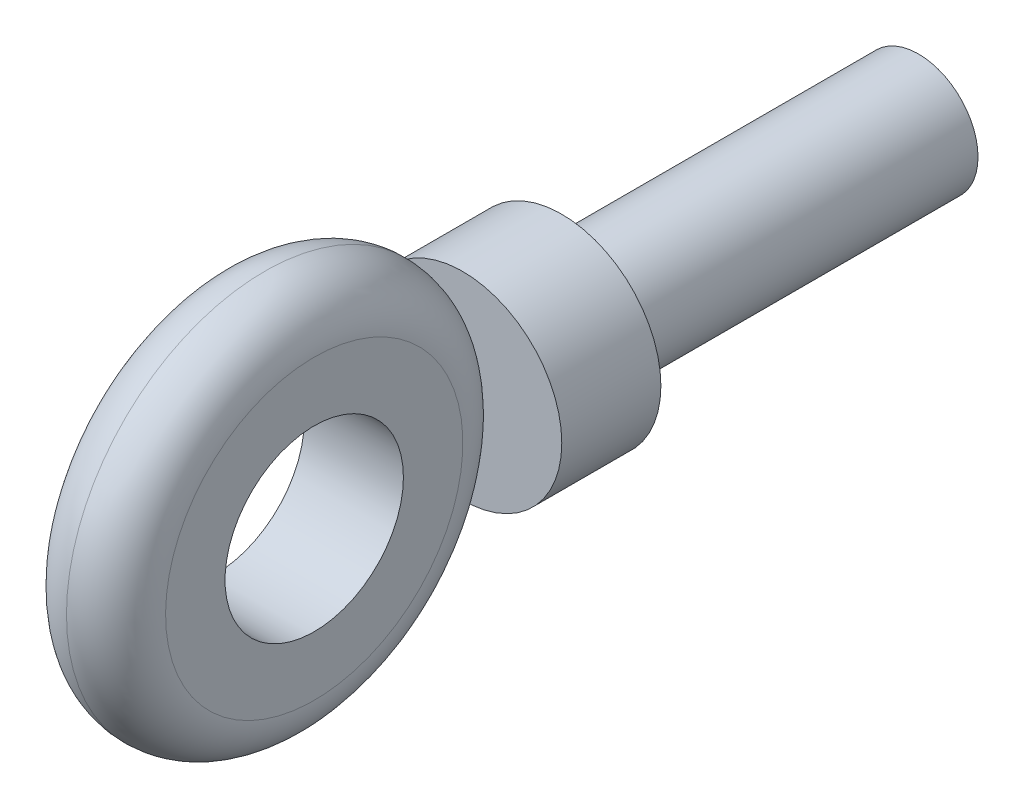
ISO-10303-21;
HEADER;
FILE_DESCRIPTION(('STEP AP214'),'2;1');
FILE_NAME('part.step','',(''),(''),'','','');
FILE_SCHEMA(('AUTOMOTIVE_DESIGN { 1 0 10303 214 1 1 1 1 }'));
ENDSEC;
DATA;
#1=APPLICATION_CONTEXT('core data for automotive mechanical design processes');
#2=APPLICATION_PROTOCOL_DEFINITION('international standard','automotive_design',2000,#1);
#3=PRODUCT_CONTEXT('',#1,'mechanical');
#4=PRODUCT('Part','Part','',(#3));
#5=PRODUCT_RELATED_PRODUCT_CATEGORY('part','',(#4));
#6=PRODUCT_DEFINITION_FORMATION('','',#4);
#7=PRODUCT_DEFINITION_CONTEXT('part definition',#1,'design');
#8=PRODUCT_DEFINITION('design','',#6,#7);
#9=PRODUCT_DEFINITION_SHAPE('','',#8);
#10=(LENGTH_UNIT() NAMED_UNIT(*) SI_UNIT(.MILLI.,.METRE.));
#11=(NAMED_UNIT(*) PLANE_ANGLE_UNIT() SI_UNIT($,.RADIAN.));
#12=(NAMED_UNIT(*) SI_UNIT($,.STERADIAN.) SOLID_ANGLE_UNIT());
#13=UNCERTAINTY_MEASURE_WITH_UNIT(LENGTH_MEASURE(1.E-05),#10,'distance_accuracy_value','');
#14=(GEOMETRIC_REPRESENTATION_CONTEXT(3) GLOBAL_UNCERTAINTY_ASSIGNED_CONTEXT((#13)) GLOBAL_UNIT_ASSIGNED_CONTEXT((#10,
#11,#12)) REPRESENTATION_CONTEXT('',''));
#15=CARTESIAN_POINT('',(0.,0.,0.));
#16=DIRECTION('',(0.,0.,1.));
#17=DIRECTION('',(1.,0.,0.));
#18=AXIS2_PLACEMENT_3D('',#15,#16,#17);
#19=CARTESIAN_POINT('',(0.,0.,23.));
#20=DIRECTION('',(0.,0.,1.));
#21=DIRECTION('',(1.,0.,0.));
#22=AXIS2_PLACEMENT_3D('',#19,#20,#21);
#23=PLANE('',#22);
#24=CARTESIAN_POINT('',(0.,-0.419259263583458,23.));
#25=CARTESIAN_POINT('',(-0.00657204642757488,-0.419277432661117,23.));
#26=CARTESIAN_POINT('',(-0.0131224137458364,-0.418642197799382,23.));
#27=CARTESIAN_POINT('',(-0.0259428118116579,-0.416228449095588,23.));
#28=CARTESIAN_POINT('',(-0.032215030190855,-0.414461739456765,23.));
#29=CARTESIAN_POINT('',(-0.0443610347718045,-0.409951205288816,23.));
#30=CARTESIAN_POINT('',(-0.0502362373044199,-0.407211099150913,23.));
#31=CARTESIAN_POINT('',(-0.0615622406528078,-0.400942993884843,23.));
#32=CARTESIAN_POINT('',(-0.0670118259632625,-0.397412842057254,23.));
#33=CARTESIAN_POINT('',(-0.081328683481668,-0.386900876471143,23.));
#34=CARTESIAN_POINT('',(-0.0897391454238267,-0.379298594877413,23.));
#35=CARTESIAN_POINT('',(-0.105316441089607,-0.362916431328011,23.));
#36=CARTESIAN_POINT('',(-0.112479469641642,-0.354133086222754,23.));
#37=CARTESIAN_POINT('',(-0.131027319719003,-0.328505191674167,23.));
#38=CARTESIAN_POINT('',(-0.141230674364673,-0.310811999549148,23.));
#39=CARTESIAN_POINT('',(-0.159036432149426,-0.27419026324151,23.));
#40=CARTESIAN_POINT('',(-0.166632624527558,-0.255258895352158,23.));
#41=CARTESIAN_POINT('',(-0.185394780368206,-0.200124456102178,23.));
#42=CARTESIAN_POINT('',(-0.194019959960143,-0.163057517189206,23.));
#43=CARTESIAN_POINT('',(-0.205755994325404,-0.0880624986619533,23.));
#44=CARTESIAN_POINT('',(-0.20885241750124,-0.0501324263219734,23.));
#45=CARTESIAN_POINT('',(-0.209993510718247,0.0285277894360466,23.));
#46=CARTESIAN_POINT('',(-0.20765978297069,0.0692635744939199,23.));
#47=CARTESIAN_POINT('',(-0.19677341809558,0.149923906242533,23.));
#48=CARTESIAN_POINT('',(-0.188233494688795,0.189849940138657,23.));
#49=CARTESIAN_POINT('',(-0.169249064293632,0.248291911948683,23.));
#50=CARTESIAN_POINT('',(-0.16175619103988,0.267767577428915,23.));
#51=CARTESIAN_POINT('',(-0.144128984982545,0.305457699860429,23.));
#52=CARTESIAN_POINT('',(-0.134007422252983,0.323677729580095,23.));
#53=CARTESIAN_POINT('',(-0.116680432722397,0.348536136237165,23.));
#54=CARTESIAN_POINT('',(-0.110842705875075,0.356124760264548,23.));
#55=CARTESIAN_POINT('',(-0.0982921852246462,0.370584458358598,23.));
#56=CARTESIAN_POINT('',(-0.0915776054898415,0.377454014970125,23.));
#57=CARTESIAN_POINT('',(-0.0770627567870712,0.390224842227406,23.));
#58=CARTESIAN_POINT('',(-0.0692463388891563,0.396108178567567,23.));
#59=CARTESIAN_POINT('',(-0.052628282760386,0.406196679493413,23.));
#60=CARTESIAN_POINT('',(-0.0438342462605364,0.410413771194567,23.));
#61=CARTESIAN_POINT('',(-0.0289310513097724,0.41540884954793,23.));
#62=CARTESIAN_POINT('',(-0.0230555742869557,0.416883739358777,23.));
#63=CARTESIAN_POINT('',(-0.0110751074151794,0.41885172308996,23.));
#64=CARTESIAN_POINT('',(-0.00496825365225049,0.419333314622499,23.));
#65=CARTESIAN_POINT('',(0.00114996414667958,0.419252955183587,23.));
#66=B_SPLINE_CURVE_WITH_KNOTS('',3,(#24,#25,#26,#27,#28,#29,#30,#31,#32,#33,#34,#35,#36,#37,#38,
#39,#40,#41,#42,#43,#44,#45,#46,#47,#48,#49,#50,#51,#52,#53,#54,#55,#56,#57,#58,#59,#60,#61,#62,
#63,#64,#65),.UNSPECIFIED.,.F.,.F.,(4,2,2,2,2,2,2,2,2,2,2,2,2,2,2,2,2,2,2,2,4),(0.,
0.0196510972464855,0.0391004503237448,0.0584762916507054,0.0779055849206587,0.111719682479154,
0.145635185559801,0.206563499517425,0.26763596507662,0.381183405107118,0.495026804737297,
0.61703834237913,0.738800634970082,0.801280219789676,0.863461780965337,0.892135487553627,
0.920868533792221,0.950077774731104,0.979073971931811,0.997168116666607,1.01547064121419),.UNSPECIFIED.);
#67=CARTESIAN_POINT('',(0.,-0.419259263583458,23.));
#68=VERTEX_POINT('',#67);
#69=CARTESIAN_POINT('',(4.42485830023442E-12,0.41925926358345,23.));
#70=VERTEX_POINT('',#69);
#71=EDGE_CURVE('E41',#68,#70,#66,.T.);
#72=ORIENTED_EDGE('',*,*,#71,.T.);
#73=CARTESIAN_POINT('',(0.,0.419259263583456,23.));
#74=CARTESIAN_POINT('',(0.00657204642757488,0.419277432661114,23.));
#75=CARTESIAN_POINT('',(0.0131224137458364,0.41864219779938,23.));
#76=CARTESIAN_POINT('',(0.0259428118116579,0.416228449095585,23.));
#77=CARTESIAN_POINT('',(0.032215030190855,0.414461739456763,23.));
#78=CARTESIAN_POINT('',(0.0443610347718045,0.409951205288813,23.));
#79=CARTESIAN_POINT('',(0.0502362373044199,0.40721109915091,23.));
#80=CARTESIAN_POINT('',(0.0615622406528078,0.40094299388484,23.));
#81=CARTESIAN_POINT('',(0.0670118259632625,0.397412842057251,23.));
#82=CARTESIAN_POINT('',(0.081328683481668,0.38690087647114,23.));
#83=CARTESIAN_POINT('',(0.0897391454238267,0.379298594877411,23.));
#84=CARTESIAN_POINT('',(0.105316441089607,0.362916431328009,23.));
#85=CARTESIAN_POINT('',(0.112479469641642,0.354133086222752,23.));
#86=CARTESIAN_POINT('',(0.131027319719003,0.328505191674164,23.));
#87=CARTESIAN_POINT('',(0.141230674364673,0.310811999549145,23.));
#88=CARTESIAN_POINT('',(0.159036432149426,0.274190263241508,23.));
#89=CARTESIAN_POINT('',(0.166632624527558,0.255258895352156,23.));
#90=CARTESIAN_POINT('',(0.185394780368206,0.200124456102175,23.));
#91=CARTESIAN_POINT('',(0.194019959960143,0.163057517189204,23.));
#92=CARTESIAN_POINT('',(0.205755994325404,0.0880624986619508,23.));
#93=CARTESIAN_POINT('',(0.20885241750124,0.0501324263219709,23.));
#94=CARTESIAN_POINT('',(0.209993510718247,-0.028527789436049,23.));
#95=CARTESIAN_POINT('',(0.20765978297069,-0.0692635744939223,23.));
#96=CARTESIAN_POINT('',(0.19677341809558,-0.149923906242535,23.));
#97=CARTESIAN_POINT('',(0.188233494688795,-0.189849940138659,23.));
#98=CARTESIAN_POINT('',(0.169249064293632,-0.248291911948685,23.));
#99=CARTESIAN_POINT('',(0.16175619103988,-0.267767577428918,23.));
#100=CARTESIAN_POINT('',(0.144128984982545,-0.305457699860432,23.));
#101=CARTESIAN_POINT('',(0.134007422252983,-0.323677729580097,23.));
#102=CARTESIAN_POINT('',(0.116680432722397,-0.348536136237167,23.));
#103=CARTESIAN_POINT('',(0.110842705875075,-0.356124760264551,23.));
#104=CARTESIAN_POINT('',(0.0982921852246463,-0.3705844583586,23.));
#105=CARTESIAN_POINT('',(0.0915776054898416,-0.377454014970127,23.));
#106=CARTESIAN_POINT('',(0.0770627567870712,-0.390224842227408,23.));
#107=CARTESIAN_POINT('',(0.0692463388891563,-0.396108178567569,23.));
#108=CARTESIAN_POINT('',(0.052628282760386,-0.406196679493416,23.));
#109=CARTESIAN_POINT('',(0.0438342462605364,-0.41041377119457,23.));
#110=CARTESIAN_POINT('',(0.0289310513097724,-0.415408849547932,23.));
#111=CARTESIAN_POINT('',(0.0230555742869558,-0.41688373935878,23.));
#112=CARTESIAN_POINT('',(0.0110751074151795,-0.418851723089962,23.));
#113=CARTESIAN_POINT('',(0.00496825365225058,-0.419333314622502,23.));
#114=CARTESIAN_POINT('',(-0.00114996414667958,-0.41925295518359,23.));
#115=B_SPLINE_CURVE_WITH_KNOTS('',3,(#73,#74,#75,#76,#77,#78,#79,#80,#81,#82,#83,#84,#85,#86,
#87,#88,#89,#90,#91,#92,#93,#94,#95,#96,#97,#98,#99,#100,#101,#102,#103,#104,#105,#106,#107,
#108,#109,#110,#111,#112,#113,#114),.UNSPECIFIED.,.F.,.F.,(4,2,2,2,2,2,2,2,2,2,2,2,2,2,2,2,2,2,
2,2,4),(0.,0.0196510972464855,0.0391004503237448,0.0584762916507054,0.0779055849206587,
0.111719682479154,0.145635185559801,0.206563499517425,0.26763596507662,0.381183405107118,
0.495026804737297,0.61703834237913,0.738800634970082,0.801280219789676,0.863461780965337,
0.892135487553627,0.920868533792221,0.950077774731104,0.979073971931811,0.997168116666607,
1.01547064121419),.UNSPECIFIED.);
#116=EDGE_CURVE('E11',#70,#68,#115,.T.);
#117=ORIENTED_EDGE('',*,*,#116,.T.);
#118=EDGE_LOOP('',(#72,#117));
#119=FACE_BOUND('',#118,.T.);
#120=CARTESIAN_POINT('',(0.,0.,23.));
#121=DIRECTION('',(0.,0.,1.));
#122=DIRECTION('',(1.,0.,0.));
#123=AXIS2_PLACEMENT_3D('',#120,#121,#122);
#124=CIRCLE('',#123,5.);
#125=CARTESIAN_POINT('',(5.,0.,23.));
#126=VERTEX_POINT('',#125);
#127=EDGE_CURVE('E108',#126,#126,#124,.T.);
#128=ORIENTED_EDGE('',*,*,#127,.T.);
#129=EDGE_LOOP('',(#128));
#130=FACE_BOUND('',#129,.T.);
#131=ADVANCED_FACE('F31',(#119,#130),#23,.T.);
#132=CARTESIAN_POINT('',(0.,0.,18.));
#133=DIRECTION('',(0.,0.,-1.));
#134=DIRECTION('',(-1.,0.,0.));
#135=AXIS2_PLACEMENT_3D('',#132,#133,#134);
#136=CYLINDRICAL_SURFACE('',#135,3.);
#137=CARTESIAN_POINT('',(0.,0.,18.));
#138=DIRECTION('',(0.,0.,1.));
#139=DIRECTION('',(1.,0.,0.));
#140=AXIS2_PLACEMENT_3D('',#137,#138,#139);
#141=CIRCLE('',#140,3.);
#142=CARTESIAN_POINT('',(3.,0.,18.));
#143=VERTEX_POINT('',#142);
#144=EDGE_CURVE('E104',#143,#143,#141,.T.);
#145=ORIENTED_EDGE('',*,*,#144,.F.);
#146=EDGE_LOOP('',(#145));
#147=FACE_BOUND('',#146,.T.);
#148=CARTESIAN_POINT('',(0.,0.,0.));
#149=DIRECTION('',(0.,0.,1.));
#150=DIRECTION('',(1.,0.,0.));
#151=AXIS2_PLACEMENT_3D('',#148,#149,#150);
#152=CIRCLE('',#151,3.);
#153=CARTESIAN_POINT('',(3.,0.,0.));
#154=VERTEX_POINT('',#153);
#155=EDGE_CURVE('E107',#154,#154,#152,.T.);
#156=ORIENTED_EDGE('',*,*,#155,.T.);
#157=EDGE_LOOP('',(#156));
#158=FACE_BOUND('',#157,.T.);
#159=ADVANCED_FACE('F82',(#147,#158),#136,.T.);
#160=CARTESIAN_POINT('',(0.,0.,0.));
#161=DIRECTION('',(0.,0.,1.));
#162=DIRECTION('',(1.,0.,0.));
#163=AXIS2_PLACEMENT_3D('',#160,#161,#162);
#164=PLANE('',#163);
#165=ORIENTED_EDGE('',*,*,#155,.F.);
#166=EDGE_LOOP('',(#165));
#167=FACE_BOUND('',#166,.T.);
#168=ADVANCED_FACE('F90',(#167),#164,.F.);
#169=CARTESIAN_POINT('',(0.,0.,18.));
#170=DIRECTION('',(0.,0.,1.));
#171=DIRECTION('',(1.,0.,0.));
#172=AXIS2_PLACEMENT_3D('',#169,#170,#171);
#173=PLANE('',#172);
#174=CARTESIAN_POINT('',(0.,0.,18.));
#175=DIRECTION('',(0.,0.,1.));
#176=DIRECTION('',(1.,0.,0.));
#177=AXIS2_PLACEMENT_3D('',#174,#175,#176);
#178=CIRCLE('',#177,5.);
#179=CARTESIAN_POINT('',(5.,0.,18.));
#180=VERTEX_POINT('',#179);
#181=EDGE_CURVE('E112',#180,#180,#178,.T.);
#182=ORIENTED_EDGE('',*,*,#181,.F.);
#183=EDGE_LOOP('',(#182));
#184=FACE_BOUND('',#183,.T.);
#185=ORIENTED_EDGE('',*,*,#144,.T.);
#186=EDGE_LOOP('',(#185));
#187=FACE_BOUND('',#186,.T.);
#188=ADVANCED_FACE('F85',(#184,#187),#173,.F.);
#189=CARTESIAN_POINT('',(0.,0.,23.));
#190=DIRECTION('',(0.,0.,-1.));
#191=DIRECTION('',(-1.,0.,0.));
#192=AXIS2_PLACEMENT_3D('',#189,#190,#191);
#193=CYLINDRICAL_SURFACE('',#192,5.);
#194=ORIENTED_EDGE('',*,*,#127,.F.);
#195=EDGE_LOOP('',(#194));
#196=FACE_BOUND('',#195,.T.);
#197=ORIENTED_EDGE('',*,*,#181,.T.);
#198=EDGE_LOOP('',(#197));
#199=FACE_BOUND('',#198,.T.);
#200=ADVANCED_FACE('F89',(#196,#199),#193,.T.);
#201=CARTESIAN_POINT('',(-2.5,0.,32.9912072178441));
#202=DIRECTION('',(1.,0.,0.));
#203=DIRECTION('',(0.,0.,-1.));
#204=AXIS2_PLACEMENT_3D('',#201,#202,#203);
#205=PLANE('',#204);
#206=CARTESIAN_POINT('',(-2.5,0.,32.9912072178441));
#207=DIRECTION('',(1.,0.,0.));
#208=DIRECTION('',(0.,0.,-1.));
#209=AXIS2_PLACEMENT_3D('',#206,#207,#208);
#210=CIRCLE('',#209,7.5);
#211=CARTESIAN_POINT('',(-2.5,0.314444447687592,25.497801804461));
#212=VERTEX_POINT('',#211);
#213=EDGE_CURVE('E51',#212,#212,#210,.F.);
#214=ORIENTED_EDGE('',*,*,#213,.T.);
#215=EDGE_LOOP('',(#214));
#216=FACE_BOUND('',#215,.T.);
#217=CARTESIAN_POINT('',(-2.5,0.,32.9912072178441));
#218=DIRECTION('',(1.,0.,0.));
#219=DIRECTION('',(0.,0.,-1.));
#220=AXIS2_PLACEMENT_3D('',#217,#218,#219);
#221=CIRCLE('',#220,4.5);
#222=CARTESIAN_POINT('',(-2.5,0.,28.4912072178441));
#223=VERTEX_POINT('',#222);
#224=EDGE_CURVE('E121',#223,#223,#221,.T.);
#225=ORIENTED_EDGE('',*,*,#224,.T.);
#226=EDGE_LOOP('',(#225));
#227=FACE_BOUND('',#226,.T.);
#228=ADVANCED_FACE('F83',(#216,#227),#205,.F.);
#229=CARTESIAN_POINT('',(-2.5,0.,32.9912072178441));
#230=DIRECTION('',(1.,0.,0.));
#231=DIRECTION('',(0.,0.,-1.));
#232=AXIS2_PLACEMENT_3D('',#229,#230,#231);
#233=CYLINDRICAL_SURFACE('',#232,4.5);
#234=ORIENTED_EDGE('',*,*,#224,.F.);
#235=EDGE_LOOP('',(#234));
#236=FACE_BOUND('',#235,.T.);
#237=CARTESIAN_POINT('',(2.5,0.,32.9912072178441));
#238=DIRECTION('',(1.,0.,0.));
#239=DIRECTION('',(0.,0.,-1.));
#240=AXIS2_PLACEMENT_3D('',#237,#238,#239);
#241=CIRCLE('',#240,4.5);
#242=CARTESIAN_POINT('',(2.5,0.,28.4912072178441));
#243=VERTEX_POINT('',#242);
#244=EDGE_CURVE('E64',#243,#243,#241,.T.);
#245=ORIENTED_EDGE('',*,*,#244,.T.);
#246=EDGE_LOOP('',(#245));
#247=FACE_BOUND('',#246,.T.);
#248=ADVANCED_FACE('F118',(#236,#247),#233,.F.);
#249=CARTESIAN_POINT('',(2.5,0.,32.9912072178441));
#250=DIRECTION('',(1.,0.,0.));
#251=DIRECTION('',(0.,0.,-1.));
#252=AXIS2_PLACEMENT_3D('',#249,#250,#251);
#253=PLANE('',#252);
#254=CARTESIAN_POINT('',(2.5,0.,32.9912072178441));
#255=DIRECTION('',(1.,0.,0.));
#256=DIRECTION('',(0.,0.,-1.));
#257=AXIS2_PLACEMENT_3D('',#254,#255,#256);
#258=CIRCLE('',#257,7.5);
#259=CARTESIAN_POINT('',(2.5,0.314444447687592,25.497801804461));
#260=VERTEX_POINT('',#259);
#261=EDGE_CURVE('E46',#260,#260,#258,.T.);
#262=ORIENTED_EDGE('',*,*,#261,.T.);
#263=EDGE_LOOP('',(#262));
#264=FACE_BOUND('',#263,.T.);
#265=ORIENTED_EDGE('',*,*,#244,.F.);
#266=EDGE_LOOP('',(#265));
#267=FACE_BOUND('',#266,.T.);
#268=ADVANCED_FACE('F130',(#264,#267),#253,.T.);
#269=CARTESIAN_POINT('',(0.,0.,32.9912072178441));
#270=DIRECTION('',(1.,0.,0.));
#271=DIRECTION('',(0.,0.,-1.));
#272=AXIS2_PLACEMENT_3D('',#269,#270,#271);
#273=TOROIDAL_SURFACE('',#272,7.5,2.5);
#274=ORIENTED_EDGE('',*,*,#261,.F.);
#275=EDGE_LOOP('',(#274));
#276=FACE_BOUND('',#275,.T.);
#277=CARTESIAN_POINT('',(0.,0.,32.9912072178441));
#278=DIRECTION('',(1.,0.,0.));
#279=DIRECTION('',(0.,0.,-1.));
#280=AXIS2_PLACEMENT_3D('',#277,#278,#279);
#281=CIRCLE('',#280,10.);
#282=EDGE_CURVE('E36',#68,#70,#281,.F.);
#283=ORIENTED_EDGE('',*,*,#282,.F.);
#284=ORIENTED_EDGE('',*,*,#116,.F.);
#285=EDGE_LOOP('',(#283,#284));
#286=FACE_BOUND('',#285,.T.);
#287=ADVANCED_FACE('F33',(#276,#286),#273,.T.);
#288=CARTESIAN_POINT('',(0.,0.,32.9912072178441));
#289=DIRECTION('',(1.,0.,0.));
#290=DIRECTION('',(0.,0.,-1.));
#291=AXIS2_PLACEMENT_3D('',#288,#289,#290);
#292=TOROIDAL_SURFACE('',#291,7.5,2.5);
#293=ORIENTED_EDGE('',*,*,#213,.F.);
#294=EDGE_LOOP('',(#293));
#295=FACE_BOUND('',#294,.T.);
#296=ORIENTED_EDGE('',*,*,#71,.F.);
#297=ORIENTED_EDGE('',*,*,#282,.T.);
#298=EDGE_LOOP('',(#296,#297));
#299=FACE_BOUND('',#298,.T.);
#300=ADVANCED_FACE('F65',(#295,#299),#292,.T.);
#301=CLOSED_SHELL('',(#131,#159,#168,#188,#200,#228,#248,#268,#287,#300));
#302=MANIFOLD_SOLID_BREP('B2',#301);
#303=ADVANCED_BREP_SHAPE_REPRESENTATION('',(#18,#302),#14);
#304=SHAPE_DEFINITION_REPRESENTATION(#9,#303);
ENDSEC;
END-ISO-10303-21;
